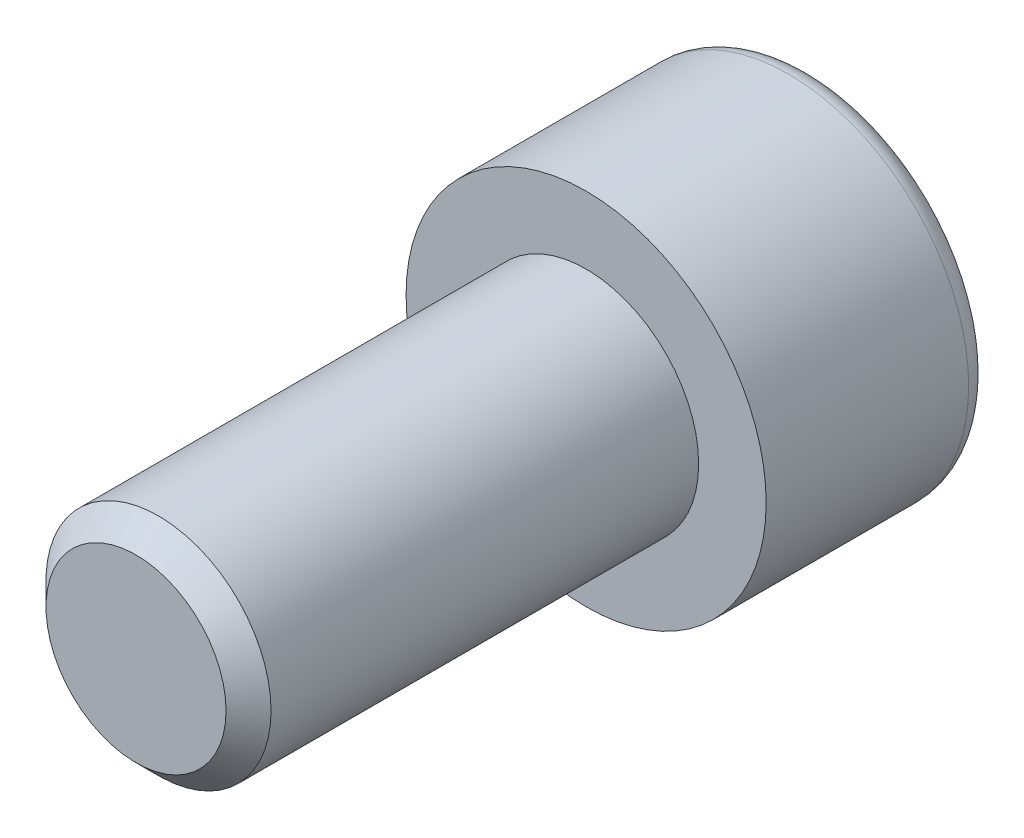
from build123d import *

# Parameters (mm, degrees)
ENLEV_MAT_EXTRU1_DEPTH = 5
ESQUISSE3_W            = 5
ESQUISSE3_H            = 20
CHANFREIN1_SIZE        = 1


with BuildPart() as part:
    # Esquisse1 → Base-R_volution (revolve)
    with BuildSketch(Plane(origin=(0, 0, 0), x_dir=(1, 0, 0), z_dir=(0, 1, 0)), mode=Mode.PRIVATE) as base_r_volution_sk:
        with BuildLine():
            Line((0, 0), (8, 0))
            Line((8, 0), (8, 9))
            ThreePointArc((8, 9), (7.707106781, 9.707106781), (7, 10))
            Line((7, 10), (0, 10))
            Line((0, 10), (0, 0))
        make_face()
    revolve(base_r_volution_sk.sketch.rotate(Axis((0, 0, 0), (0, 0, -1)), 180), axis=Axis((0, 0, 0), (0, 0, -1)))

    # Esquisse2 → enlev-mat-Extru1 (cut)
    with BuildSketch(Plane.XY.offset(-10)):
        Polygon((4, -2.309401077), (4, 2.309401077), (0, 4.618802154), (-4, 2.309401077), (-4, -2.309401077), (0, -4.618802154), align=None)
    extrude(amount=ENLEV_MAT_EXTRU1_DEPTH, mode=Mode.SUBTRACT)

    # Esquisse3 → Boss.-R_vol.1 (revolve)
    with BuildSketch(Plane(origin=(0, 0, 0), x_dir=(1, 0, 0), z_dir=(0, 1, 0))):
        with Locations((2.5, -10)):
            Rectangle(ESQUISSE3_W, ESQUISSE3_H)
    revolve(axis=Axis((0, 0, 0), (0, 0, 1)))

    # Chanfrein1
    chanfrein1_edges = [part.edges().sort_by_distance(p)[0] for p in [
        (-5, 0, 20),
    ]]
    chamfer(chanfrein1_edges, length=CHANFREIN1_SIZE)


solid = part.part
